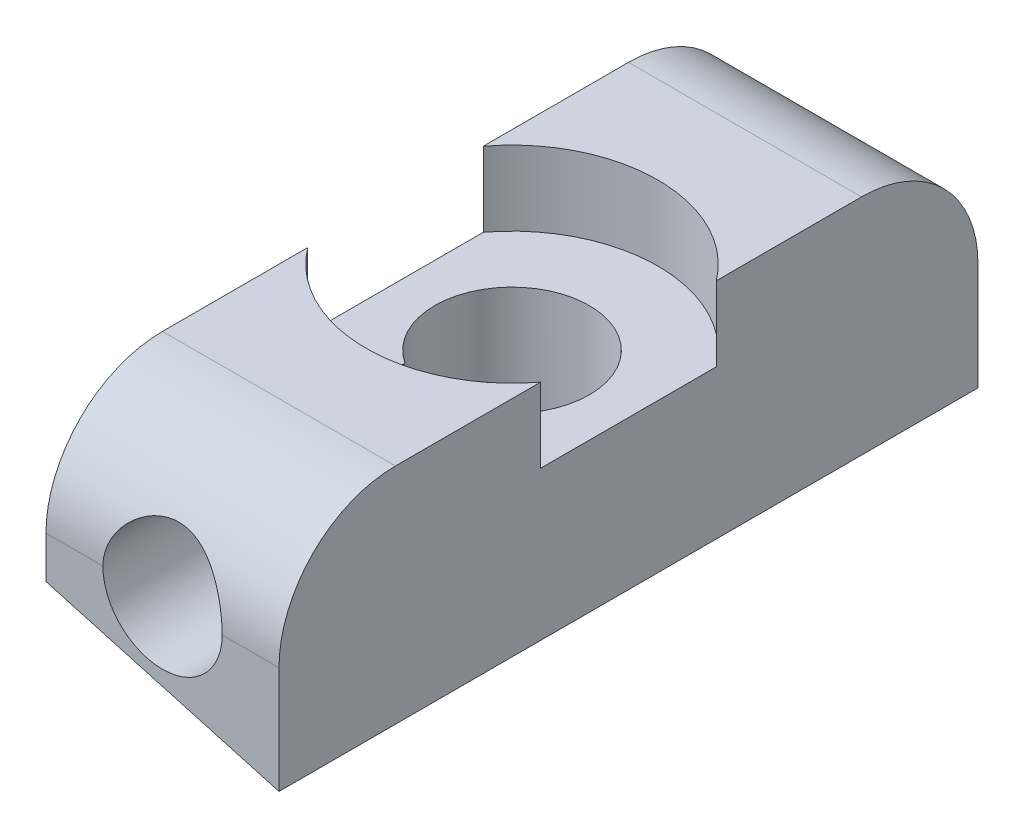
ISO-10303-21;
HEADER;
FILE_DESCRIPTION(('STEP AP214'),'2;1');
FILE_NAME('part.step','',(''),(''),'','','');
FILE_SCHEMA(('AUTOMOTIVE_DESIGN { 1 0 10303 214 1 1 1 1 }'));
ENDSEC;
DATA;
#1=APPLICATION_CONTEXT('core data for automotive mechanical design processes');
#2=APPLICATION_PROTOCOL_DEFINITION('international standard','automotive_design',2000,#1);
#3=PRODUCT_CONTEXT('',#1,'mechanical');
#4=PRODUCT('Part','Part','',(#3));
#5=PRODUCT_RELATED_PRODUCT_CATEGORY('part','',(#4));
#6=PRODUCT_DEFINITION_FORMATION('','',#4);
#7=PRODUCT_DEFINITION_CONTEXT('part definition',#1,'design');
#8=PRODUCT_DEFINITION('design','',#6,#7);
#9=PRODUCT_DEFINITION_SHAPE('','',#8);
#10=(LENGTH_UNIT() NAMED_UNIT(*) SI_UNIT(.MILLI.,.METRE.));
#11=(NAMED_UNIT(*) PLANE_ANGLE_UNIT() SI_UNIT($,.RADIAN.));
#12=(NAMED_UNIT(*) SI_UNIT($,.STERADIAN.) SOLID_ANGLE_UNIT());
#13=UNCERTAINTY_MEASURE_WITH_UNIT(LENGTH_MEASURE(1.E-05),#10,'distance_accuracy_value','');
#14=(GEOMETRIC_REPRESENTATION_CONTEXT(3) GLOBAL_UNCERTAINTY_ASSIGNED_CONTEXT((#13)) GLOBAL_UNIT_ASSIGNED_CONTEXT((#10,
#11,#12)) REPRESENTATION_CONTEXT('',''));
#15=CARTESIAN_POINT('',(0.,0.,0.));
#16=DIRECTION('',(0.,0.,1.));
#17=DIRECTION('',(1.,0.,0.));
#18=AXIS2_PLACEMENT_3D('',#15,#16,#17);
#19=CARTESIAN_POINT('',(-40.64,98.9032922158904,19.05));
#20=DIRECTION('',(0.,-1.,0.));
#21=DIRECTION('',(0.,0.,-1.));
#22=AXIS2_PLACEMENT_3D('',#19,#20,#21);
#23=PLANE('',#22);
#24=DIRECTION('',(0.,0.,-1.));
#25=VECTOR('',#24,1.);
#26=CARTESIAN_POINT('',(-34.29,98.9032922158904,19.05));
#27=LINE('',#26,#25);
#28=CARTESIAN_POINT('',(-34.29,98.9032922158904,15.875));
#29=VERTEX_POINT('',#28);
#30=CARTESIAN_POINT('',(-34.29,98.9032922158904,11.9168183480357));
#31=VERTEX_POINT('',#30);
#32=EDGE_CURVE('E190',#29,#31,#27,.T.);
#33=ORIENTED_EDGE('',*,*,#32,.T.);
#34=CARTESIAN_POINT('',(-37.465,98.9032922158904,9.525));
#35=DIRECTION('',(0.,1.,0.));
#36=DIRECTION('',(0.,0.,1.));
#37=AXIS2_PLACEMENT_3D('',#34,#35,#36);
#38=CIRCLE('',#37,3.97510000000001);
#39=CARTESIAN_POINT('',(-40.64,98.9032922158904,11.9168183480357));
#40=VERTEX_POINT('',#39);
#41=EDGE_CURVE('E144',#40,#31,#38,.T.);
#42=ORIENTED_EDGE('',*,*,#41,.F.);
#43=DIRECTION('',(0.,0.,-1.));
#44=VECTOR('',#43,1.);
#45=CARTESIAN_POINT('',(-40.64,98.9032922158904,19.05));
#46=LINE('',#45,#44);
#47=CARTESIAN_POINT('',(-40.64,98.9032922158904,15.875));
#48=VERTEX_POINT('',#47);
#49=EDGE_CURVE('E181',#48,#40,#46,.T.);
#50=ORIENTED_EDGE('',*,*,#49,.F.);
#51=DIRECTION('',(-1.,0.,0.));
#52=VECTOR('',#51,1.);
#53=CARTESIAN_POINT('',(-34.29,98.9032922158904,15.875));
#54=LINE('',#53,#52);
#55=EDGE_CURVE('E201',#48,#29,#54,.F.);
#56=ORIENTED_EDGE('',*,*,#55,.T.);
#57=EDGE_LOOP('',(#33,#42,#50,#56));
#58=FACE_BOUND('',#57,.T.);
#59=ADVANCED_FACE('F33',(#58),#23,.F.);
#60=CARTESIAN_POINT('',(-37.465,92.8072922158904,9.525));
#61=DIRECTION('',(0.,1.,0.));
#62=DIRECTION('',(0.,0.,1.));
#63=AXIS2_PLACEMENT_3D('',#60,#61,#62);
#64=CYLINDRICAL_SURFACE('',#63,2.1082);
#65=CARTESIAN_POINT('',(-37.465,93.6962922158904,9.525));
#66=DIRECTION('',(0.269629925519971,0.962964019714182,0.));
#67=DIRECTION('',(-0.962964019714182,0.269629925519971,0.));
#68=AXIS2_PLACEMENT_3D('',#65,#66,#67);
#69=ELLIPSE('',#68,2.18928221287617,2.1082);
#70=CARTESIAN_POINT('',(-39.5732,94.2865882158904,9.525));
#71=VERTEX_POINT('',#70);
#72=EDGE_CURVE('E260',#71,#71,#69,.T.);
#73=ORIENTED_EDGE('',*,*,#72,.F.);
#74=EDGE_LOOP('',(#73));
#75=FACE_BOUND('',#74,.T.);
#76=CARTESIAN_POINT('',(-37.465,96.8712922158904,9.525));
#77=DIRECTION('',(0.,1.,0.));
#78=DIRECTION('',(0.,0.,1.));
#79=AXIS2_PLACEMENT_3D('',#76,#77,#78);
#80=CIRCLE('',#79,2.1082);
#81=CARTESIAN_POINT('',(-38.620909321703,96.8712922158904,11.2880600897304));
#82=VERTEX_POINT('',#81);
#83=CARTESIAN_POINT('',(-36.309090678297,96.8712922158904,11.2880600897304));
#84=VERTEX_POINT('',#83);
#85=EDGE_CURVE('E141',#82,#84,#80,.F.);
#86=ORIENTED_EDGE('',*,*,#85,.F.);
#87=CARTESIAN_POINT('',(-36.309090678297,96.8712922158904,11.2880600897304));
#88=CARTESIAN_POINT('',(-36.2763970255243,96.8382149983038,11.2666321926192));
#89=CARTESIAN_POINT('',(-36.2452161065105,96.8038572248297,11.2448822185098));
#90=CARTESIAN_POINT('',(-36.1859072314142,96.7326110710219,11.2012397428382));
#91=CARTESIAN_POINT('',(-36.1577824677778,96.6957201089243,11.1793471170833));
#92=CARTESIAN_POINT('',(-36.1043284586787,96.6190003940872,11.1356792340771));
#93=CARTESIAN_POINT('',(-36.0790413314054,96.5791391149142,11.1139094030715));
#94=CARTESIAN_POINT('',(-36.0318304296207,96.496956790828,11.0714605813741));
#95=CARTESIAN_POINT('',(-36.0099049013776,96.454637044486,11.0507810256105));
#96=CARTESIAN_POINT('',(-35.9611052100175,96.3491995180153,11.0029739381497));
#97=CARTESIAN_POINT('',(-35.9360129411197,96.2848037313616,10.976780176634));
#98=CARTESIAN_POINT('',(-35.8938904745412,96.1514249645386,10.9310914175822));
#99=CARTESIAN_POINT('',(-35.8768210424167,96.0824662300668,10.9115639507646));
#100=CARTESIAN_POINT('',(-35.854020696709,95.9536514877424,10.8849657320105));
#101=CARTESIAN_POINT('',(-35.8467973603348,95.8944050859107,10.8762807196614));
#102=CARTESIAN_POINT('',(-35.8389657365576,95.7748489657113,10.866850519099));
#103=CARTESIAN_POINT('',(-35.8383530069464,95.7145399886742,10.8660999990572));
#104=CARTESIAN_POINT('',(-35.8437839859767,95.5947782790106,10.8726571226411));
#105=CARTESIAN_POINT('',(-35.8498181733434,95.5353244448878,10.8799532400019));
#106=CARTESIAN_POINT('',(-35.8680712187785,95.4186200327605,10.9014153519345));
#107=CARTESIAN_POINT('',(-35.8803008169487,95.3613734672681,10.9155932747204));
#108=CARTESIAN_POINT('',(-35.9173312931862,95.2238283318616,10.9568883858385));
#109=CARTESIAN_POINT('',(-35.945337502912,95.1452947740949,10.9869556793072));
#110=CARTESIAN_POINT('',(-36.0116734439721,94.9953726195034,11.0529214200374));
#111=CARTESIAN_POINT('',(-36.0500262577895,94.9240004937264,11.0888328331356));
#112=CARTESIAN_POINT('',(-36.1380397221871,94.7855549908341,11.1642645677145));
#113=CARTESIAN_POINT('',(-36.1881101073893,94.7187912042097,11.2038732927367));
#114=CARTESIAN_POINT('',(-36.2981370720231,94.5934113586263,11.2821274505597));
#115=CARTESIAN_POINT('',(-36.3580868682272,94.5347897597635,11.3207735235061));
#116=CARTESIAN_POINT('',(-36.4870209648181,94.4270949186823,11.3940940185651));
#117=CARTESIAN_POINT('',(-36.5559111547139,94.3779338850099,11.4288035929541));
#118=CARTESIAN_POINT('',(-36.7026025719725,94.2900245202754,11.4921346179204));
#119=CARTESIAN_POINT('',(-36.780395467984,94.2512665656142,11.5207616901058));
#120=CARTESIAN_POINT('',(-36.9305172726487,94.1912967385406,11.5655779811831));
#121=CARTESIAN_POINT('',(-37.0017433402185,94.1682735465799,11.5830219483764));
#122=CARTESIAN_POINT('',(-37.1480320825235,94.1321183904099,11.6105608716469));
#123=CARTESIAN_POINT('',(-37.2230921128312,94.1189797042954,11.6206608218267));
#124=CARTESIAN_POINT('',(-37.3752364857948,94.1033667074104,11.6326739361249));
#125=CARTESIAN_POINT('',(-37.4523267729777,94.100928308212,11.6345595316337));
#126=CARTESIAN_POINT('',(-37.6058193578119,94.1069825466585,11.6298926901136));
#127=CARTESIAN_POINT('',(-37.6822215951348,94.1154761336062,11.6233395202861));
#128=CARTESIAN_POINT('',(-37.8280800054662,94.142113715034,11.6029379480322));
#129=CARTESIAN_POINT('',(-37.8976907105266,94.1597321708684,11.5894871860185));
#130=CARTESIAN_POINT('',(-38.0326794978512,94.2033815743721,11.5565216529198));
#131=CARTESIAN_POINT('',(-38.0980566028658,94.2294144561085,11.5370054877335));
#132=CARTESIAN_POINT('',(-38.2295871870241,94.2917078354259,11.4910168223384));
#133=CARTESIAN_POINT('',(-38.295216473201,94.328708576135,11.4640574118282));
#134=CARTESIAN_POINT('',(-38.4195134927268,94.410332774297,11.4059907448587));
#135=CARTESIAN_POINT('',(-38.4781766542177,94.4549611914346,11.3748807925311));
#136=CARTESIAN_POINT('',(-38.5991749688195,94.560435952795,11.3037648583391));
#137=CARTESIAN_POINT('',(-38.659919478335,94.6227424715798,11.2632202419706));
#138=CARTESIAN_POINT('',(-38.7707014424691,94.7560555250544,11.1816175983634));
#139=CARTESIAN_POINT('',(-38.8207285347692,94.8270703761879,11.1405591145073));
#140=CARTESIAN_POINT('',(-38.9037579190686,94.967806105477,11.0668026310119));
#141=CARTESIAN_POINT('',(-38.9381237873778,95.0365126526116,11.0337093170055));
#142=CARTESIAN_POINT('',(-38.9974166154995,95.1803022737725,10.9734440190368));
#143=CARTESIAN_POINT('',(-39.0223639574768,95.2553711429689,10.9462593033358));
#144=CARTESIAN_POINT('',(-39.0564250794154,95.391366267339,10.9078817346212));
#145=CARTESIAN_POINT('',(-39.0679542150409,95.4510175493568,10.8943786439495));
#146=CARTESIAN_POINT('',(-39.0842624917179,95.5724144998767,10.8750603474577));
#147=CARTESIAN_POINT('',(-39.0890542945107,95.6341560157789,10.8692307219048));
#148=CARTESIAN_POINT('',(-39.0915115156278,95.7582148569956,10.8662582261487));
#149=CARTESIAN_POINT('',(-39.0891525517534,95.8205334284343,10.8691450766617));
#150=CARTESIAN_POINT('',(-39.0774688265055,95.9435953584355,10.8831337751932));
#151=CARTESIAN_POINT('',(-39.0681341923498,96.0043363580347,10.8942472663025));
#152=CARTESIAN_POINT('',(-39.039435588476,96.1404912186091,10.9272336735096));
#153=CARTESIAN_POINT('',(-39.017914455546,96.2148961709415,10.9513235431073));
#154=CARTESIAN_POINT('',(-38.9656564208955,96.3579349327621,11.0062069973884));
#155=CARTESIAN_POINT('',(-38.9348806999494,96.4265428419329,11.0370286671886));
#156=CARTESIAN_POINT('',(-38.8623906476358,96.5627148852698,11.1043782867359));
#157=CARTESIAN_POINT('',(-38.8200226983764,96.6298033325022,11.1411618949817));
#158=CARTESIAN_POINT('',(-38.7499751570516,96.7247551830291,11.1965940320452));
#159=CARTESIAN_POINT('',(-38.7256842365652,96.7553165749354,11.2150190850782));
#160=CARTESIAN_POINT('',(-38.6749260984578,96.8146504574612,11.2517211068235));
#161=CARTESIAN_POINT('',(-38.6484595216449,96.8434234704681,11.2699981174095));
#162=CARTESIAN_POINT('',(-38.620909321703,96.8712922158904,11.2880600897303));
#163=B_SPLINE_CURVE_WITH_KNOTS('',3,(#87,#88,#89,#90,#91,#92,#93,#94,#95,#96,#97,#98,#99,#100,
#101,#102,#103,#104,#105,#106,#107,#108,#109,#110,#111,#112,#113,#114,#115,#116,#117,#118,#119,
#120,#121,#122,#123,#124,#125,#126,#127,#128,#129,#130,#131,#132,#133,#134,#135,#136,#137,#138,
#139,#140,#141,#142,#143,#144,#145,#146,#147,#148,#149,#150,#151,#152,#153,#154,#155,#156,#157,
#158,#159,#160,#161,#162),.UNSPECIFIED.,.F.,.F.,(4,2,2,2,2,2,2,2,2,2,2,2,2,2,2,2,2,2,2,2,2,2,2,
2,2,2,2,2,2,2,2,2,2,2,2,2,2,4),(0.,0.153575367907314,0.307309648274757,0.46308698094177,
0.61878276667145,0.839785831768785,1.05969657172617,1.23983062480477,1.41984362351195,
1.59959910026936,1.77966726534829,2.04409559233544,2.30911878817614,2.5853536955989,
2.8613997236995,3.13474550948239,3.40783755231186,3.63743813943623,3.86688244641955,
4.09709621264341,4.32732997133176,4.54557516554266,4.76387055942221,5.00305191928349,
5.24238939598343,5.52933373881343,5.8165542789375,6.06673188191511,6.31636494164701,
6.50234171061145,6.68796849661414,6.87422893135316,7.06075348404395,7.30275281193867,
7.54578173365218,7.80728256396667,7.9367123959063,8.06610424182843),.UNSPECIFIED.);
#164=EDGE_CURVE('E125',#84,#82,#163,.T.);
#165=ORIENTED_EDGE('',*,*,#164,.F.);
#166=EDGE_LOOP('',(#86,#165));
#167=FACE_BOUND('',#166,.T.);
#168=ADVANCED_FACE('F146',(#75,#167),#64,.F.);
#169=CARTESIAN_POINT('',(-40.64,94.5852922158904,19.05));
#170=DIRECTION('',(0.269629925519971,0.962964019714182,0.));
#171=DIRECTION('',(-0.962964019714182,0.269629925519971,0.));
#172=AXIS2_PLACEMENT_3D('',#169,#170,#171);
#173=PLANE('',#172);
#174=ORIENTED_EDGE('',*,*,#72,.T.);
#175=EDGE_LOOP('',(#174));
#176=FACE_BOUND('',#175,.T.);
#177=DIRECTION('',(0.962964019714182,-0.269629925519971,0.));
#178=VECTOR('',#177,1.);
#179=CARTESIAN_POINT('',(-40.64,94.5852922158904,0.));
#180=LINE('',#179,#178);
#181=CARTESIAN_POINT('',(-40.64,94.5852922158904,0.));
#182=VERTEX_POINT('',#181);
#183=CARTESIAN_POINT('',(-34.29,92.8072922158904,0.));
#184=VERTEX_POINT('',#183);
#185=EDGE_CURVE('E263',#182,#184,#180,.T.);
#186=ORIENTED_EDGE('',*,*,#185,.T.);
#187=DIRECTION('',(0.,0.,-1.));
#188=VECTOR('',#187,1.);
#189=CARTESIAN_POINT('',(-34.29,92.8072922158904,19.05));
#190=LINE('',#189,#188);
#191=CARTESIAN_POINT('',(-34.29,92.8072922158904,19.05));
#192=VERTEX_POINT('',#191);
#193=EDGE_CURVE('E193',#192,#184,#190,.T.);
#194=ORIENTED_EDGE('',*,*,#193,.F.);
#195=DIRECTION('',(0.962964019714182,-0.269629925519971,0.));
#196=VECTOR('',#195,1.);
#197=CARTESIAN_POINT('',(-40.64,94.5852922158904,19.05));
#198=LINE('',#197,#196);
#199=CARTESIAN_POINT('',(-40.64,94.5852922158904,19.05));
#200=VERTEX_POINT('',#199);
#201=EDGE_CURVE('E219',#200,#192,#198,.T.);
#202=ORIENTED_EDGE('',*,*,#201,.F.);
#203=DIRECTION('',(0.,0.,-1.));
#204=VECTOR('',#203,1.);
#205=CARTESIAN_POINT('',(-40.64,94.5852922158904,19.05));
#206=LINE('',#205,#204);
#207=EDGE_CURVE('E182',#200,#182,#206,.T.);
#208=ORIENTED_EDGE('',*,*,#207,.T.);
#209=EDGE_LOOP('',(#186,#194,#202,#208));
#210=FACE_BOUND('',#209,.T.);
#211=ADVANCED_FACE('F35',(#176,#210),#173,.F.);
#212=CARTESIAN_POINT('',(-34.29,92.8072922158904,19.05));
#213=DIRECTION('',(-1.,0.,0.));
#214=DIRECTION('',(0.,0.,1.));
#215=AXIS2_PLACEMENT_3D('',#212,#213,#214);
#216=PLANE('',#215);
#217=DIRECTION('',(0.,1.,0.));
#218=VECTOR('',#217,1.);
#219=CARTESIAN_POINT('',(-34.29,92.8072922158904,0.));
#220=LINE('',#219,#218);
#221=CARTESIAN_POINT('',(-34.29,95.7282922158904,0.));
#222=VERTEX_POINT('',#221);
#223=EDGE_CURVE('E266',#184,#222,#220,.T.);
#224=ORIENTED_EDGE('',*,*,#223,.T.);
#225=CARTESIAN_POINT('',(-34.29,95.7282922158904,3.175));
#226=DIRECTION('',(-1.,0.,0.));
#227=DIRECTION('',(0.,0.,1.));
#228=AXIS2_PLACEMENT_3D('',#225,#226,#227);
#229=CIRCLE('',#228,3.175);
#230=CARTESIAN_POINT('',(-34.29,98.9032922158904,3.17500000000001));
#231=VERTEX_POINT('',#230);
#232=EDGE_CURVE('E11',#222,#231,#229,.F.);
#233=ORIENTED_EDGE('',*,*,#232,.T.);
#234=CARTESIAN_POINT('',(-34.29,98.9032922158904,7.13318165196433));
#235=VERTEX_POINT('',#234);
#236=EDGE_CURVE('E175',#235,#231,#27,.T.);
#237=ORIENTED_EDGE('',*,*,#236,.F.);
#238=DIRECTION('',(0.,1.,0.));
#239=VECTOR('',#238,1.);
#240=CARTESIAN_POINT('',(-34.29,96.8712922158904,7.13318165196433));
#241=LINE('',#240,#239);
#242=CARTESIAN_POINT('',(-34.29,96.8712922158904,7.13318165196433));
#243=VERTEX_POINT('',#242);
#244=EDGE_CURVE('E255',#235,#243,#241,.F.);
#245=ORIENTED_EDGE('',*,*,#244,.T.);
#246=DIRECTION('',(0.,0.,-1.));
#247=VECTOR('',#246,1.);
#248=CARTESIAN_POINT('',(-34.29,96.8712922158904,19.05));
#249=LINE('',#248,#247);
#250=CARTESIAN_POINT('',(-34.29,96.8712922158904,11.9168183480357));
#251=VERTEX_POINT('',#250);
#252=EDGE_CURVE('E150',#251,#243,#249,.T.);
#253=ORIENTED_EDGE('',*,*,#252,.F.);
#254=DIRECTION('',(0.,1.,0.));
#255=VECTOR('',#254,1.);
#256=CARTESIAN_POINT('',(-34.29,96.8712922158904,11.9168183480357));
#257=LINE('',#256,#255);
#258=EDGE_CURVE('E258',#251,#31,#257,.T.);
#259=ORIENTED_EDGE('',*,*,#258,.T.);
#260=ORIENTED_EDGE('',*,*,#32,.F.);
#261=CARTESIAN_POINT('',(-34.29,95.7282922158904,15.875));
#262=DIRECTION('',(-1.,0.,0.));
#263=DIRECTION('',(0.,0.,1.));
#264=AXIS2_PLACEMENT_3D('',#261,#262,#263);
#265=CIRCLE('',#264,3.175);
#266=CARTESIAN_POINT('',(-34.29,95.7282922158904,19.05));
#267=VERTEX_POINT('',#266);
#268=EDGE_CURVE('E156',#29,#267,#265,.F.);
#269=ORIENTED_EDGE('',*,*,#268,.T.);
#270=DIRECTION('',(0.,1.,0.));
#271=VECTOR('',#270,1.);
#272=CARTESIAN_POINT('',(-34.29,92.8072922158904,19.05));
#273=LINE('',#272,#271);
#274=EDGE_CURVE('E210',#192,#267,#273,.T.);
#275=ORIENTED_EDGE('',*,*,#274,.F.);
#276=ORIENTED_EDGE('',*,*,#193,.T.);
#277=EDGE_LOOP('',(#224,#233,#237,#245,#253,#259,#260,#269,#275,#276));
#278=FACE_BOUND('',#277,.T.);
#279=ADVANCED_FACE('F209',(#278),#216,.F.);
#280=ORIENTED_EDGE('',*,*,#236,.T.);
#281=DIRECTION('',(-1.,0.,0.));
#282=VECTOR('',#281,1.);
#283=CARTESIAN_POINT('',(-40.64,98.9032922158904,3.175));
#284=LINE('',#283,#282);
#285=CARTESIAN_POINT('',(-40.64,98.9032922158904,3.17500000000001));
#286=VERTEX_POINT('',#285);
#287=EDGE_CURVE('E164',#231,#286,#284,.T.);
#288=ORIENTED_EDGE('',*,*,#287,.T.);
#289=CARTESIAN_POINT('',(-40.64,98.9032922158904,7.13318165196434));
#290=VERTEX_POINT('',#289);
#291=EDGE_CURVE('E173',#290,#286,#46,.T.);
#292=ORIENTED_EDGE('',*,*,#291,.F.);
#293=EDGE_CURVE('E252',#235,#290,#38,.T.);
#294=ORIENTED_EDGE('',*,*,#293,.F.);
#295=EDGE_LOOP('',(#280,#288,#292,#294));
#296=FACE_BOUND('',#295,.T.);
#297=ADVANCED_FACE('F171',(#296),#23,.F.);
#298=CARTESIAN_POINT('',(-40.64,94.5852922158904,19.05));
#299=DIRECTION('',(1.,0.,0.));
#300=DIRECTION('',(0.,0.,-1.));
#301=AXIS2_PLACEMENT_3D('',#298,#299,#300);
#302=PLANE('',#301);
#303=ORIENTED_EDGE('',*,*,#291,.T.);
#304=CARTESIAN_POINT('',(-40.64,95.7282922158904,3.175));
#305=DIRECTION('',(1.,0.,0.));
#306=DIRECTION('',(0.,0.,-1.));
#307=AXIS2_PLACEMENT_3D('',#304,#305,#306);
#308=CIRCLE('',#307,3.175);
#309=CARTESIAN_POINT('',(-40.64,95.7282922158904,0.));
#310=VERTEX_POINT('',#309);
#311=EDGE_CURVE('E55',#286,#310,#308,.F.);
#312=ORIENTED_EDGE('',*,*,#311,.T.);
#313=DIRECTION('',(0.,-1.,0.));
#314=VECTOR('',#313,1.);
#315=CARTESIAN_POINT('',(-40.64,94.5852922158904,0.));
#316=LINE('',#315,#314);
#317=EDGE_CURVE('E268',#310,#182,#316,.T.);
#318=ORIENTED_EDGE('',*,*,#317,.T.);
#319=ORIENTED_EDGE('',*,*,#207,.F.);
#320=DIRECTION('',(0.,-1.,0.));
#321=VECTOR('',#320,1.);
#322=CARTESIAN_POINT('',(-40.64,94.5852922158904,19.05));
#323=LINE('',#322,#321);
#324=CARTESIAN_POINT('',(-40.64,95.7282922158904,19.05));
#325=VERTEX_POINT('',#324);
#326=EDGE_CURVE('E186',#325,#200,#323,.T.);
#327=ORIENTED_EDGE('',*,*,#326,.F.);
#328=CARTESIAN_POINT('',(-40.64,95.7282922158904,15.875));
#329=DIRECTION('',(1.,0.,0.));
#330=DIRECTION('',(0.,0.,-1.));
#331=AXIS2_PLACEMENT_3D('',#328,#329,#330);
#332=CIRCLE('',#331,3.175);
#333=EDGE_CURVE('E200',#325,#48,#332,.F.);
#334=ORIENTED_EDGE('',*,*,#333,.T.);
#335=ORIENTED_EDGE('',*,*,#49,.T.);
#336=DIRECTION('',(0.,1.,0.));
#337=VECTOR('',#336,1.);
#338=CARTESIAN_POINT('',(-40.64,96.8712922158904,11.9168183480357));
#339=LINE('',#338,#337);
#340=CARTESIAN_POINT('',(-40.64,96.8712922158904,11.9168183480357));
#341=VERTEX_POINT('',#340);
#342=EDGE_CURVE('E158',#40,#341,#339,.F.);
#343=ORIENTED_EDGE('',*,*,#342,.T.);
#344=DIRECTION('',(0.,0.,1.));
#345=VECTOR('',#344,1.);
#346=CARTESIAN_POINT('',(-40.64,96.8712922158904,19.05));
#347=LINE('',#346,#345);
#348=CARTESIAN_POINT('',(-40.64,96.8712922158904,7.13318165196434));
#349=VERTEX_POINT('',#348);
#350=EDGE_CURVE('E147',#349,#341,#347,.T.);
#351=ORIENTED_EDGE('',*,*,#350,.F.);
#352=DIRECTION('',(0.,1.,0.));
#353=VECTOR('',#352,1.);
#354=CARTESIAN_POINT('',(-40.64,96.8712922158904,7.13318165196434));
#355=LINE('',#354,#353);
#356=EDGE_CURVE('E161',#349,#290,#355,.T.);
#357=ORIENTED_EDGE('',*,*,#356,.T.);
#358=EDGE_LOOP('',(#303,#312,#318,#319,#327,#334,#335,#343,#351,#357));
#359=FACE_BOUND('',#358,.T.);
#360=ADVANCED_FACE('F178',(#359),#302,.F.);
#361=CARTESIAN_POINT('',(-34.29,92.8072922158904,19.05));
#362=DIRECTION('',(0.,0.,1.));
#363=DIRECTION('',(1.,0.,0.));
#364=AXIS2_PLACEMENT_3D('',#361,#362,#363);
#365=PLANE('',#364);
#366=CARTESIAN_POINT('',(-37.465,95.7282922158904,19.05));
#367=DIRECTION('',(0.,0.,1.));
#368=DIRECTION('',(1.,0.,0.));
#369=AXIS2_PLACEMENT_3D('',#366,#367,#368);
#370=CIRCLE('',#369,1.6256);
#371=CARTESIAN_POINT('',(-39.0906,95.7282922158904,19.05));
#372=VERTEX_POINT('',#371);
#373=CARTESIAN_POINT('',(-35.8394,95.7282922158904,19.05));
#374=VERTEX_POINT('',#373);
#375=EDGE_CURVE('E227',#372,#374,#370,.T.);
#376=ORIENTED_EDGE('',*,*,#375,.F.);
#377=DIRECTION('',(-1.,0.,0.));
#378=VECTOR('',#377,1.);
#379=CARTESIAN_POINT('',(-34.29,95.7282922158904,19.05));
#380=LINE('',#379,#378);
#381=EDGE_CURVE('E196',#372,#325,#380,.T.);
#382=ORIENTED_EDGE('',*,*,#381,.T.);
#383=ORIENTED_EDGE('',*,*,#326,.T.);
#384=ORIENTED_EDGE('',*,*,#201,.T.);
#385=ORIENTED_EDGE('',*,*,#274,.T.);
#386=EDGE_CURVE('E197',#267,#374,#380,.T.);
#387=ORIENTED_EDGE('',*,*,#386,.T.);
#388=EDGE_LOOP('',(#376,#382,#383,#384,#385,#387));
#389=FACE_BOUND('',#388,.T.);
#390=ADVANCED_FACE('F217',(#389),#365,.T.);
#391=CARTESIAN_POINT('',(-34.29,92.8072922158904,0.));
#392=DIRECTION('',(0.,0.,1.));
#393=DIRECTION('',(1.,0.,0.));
#394=AXIS2_PLACEMENT_3D('',#391,#392,#393);
#395=PLANE('',#394);
#396=ORIENTED_EDGE('',*,*,#317,.F.);
#397=DIRECTION('',(-1.,0.,0.));
#398=VECTOR('',#397,1.);
#399=CARTESIAN_POINT('',(-34.29,95.7282922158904,0.));
#400=LINE('',#399,#398);
#401=EDGE_CURVE('E41',#310,#222,#400,.F.);
#402=ORIENTED_EDGE('',*,*,#401,.T.);
#403=ORIENTED_EDGE('',*,*,#223,.F.);
#404=ORIENTED_EDGE('',*,*,#185,.F.);
#405=EDGE_LOOP('',(#396,#402,#403,#404));
#406=FACE_BOUND('',#405,.T.);
#407=ADVANCED_FACE('F352',(#406),#395,.F.);
#408=CARTESIAN_POINT('',(-34.29,95.7282922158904,15.875));
#409=DIRECTION('',(1.,0.,0.));
#410=DIRECTION('',(0.,0.,-1.));
#411=AXIS2_PLACEMENT_3D('',#408,#409,#410);
#412=CYLINDRICAL_SURFACE('',#411,3.175);
#413=CARTESIAN_POINT('',(-39.0906,95.7282922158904,19.05));
#414=CARTESIAN_POINT('',(-39.090606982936,95.7710783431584,19.0500077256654));
#415=CARTESIAN_POINT('',(-39.0889109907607,95.8138594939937,19.0491353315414));
#416=CARTESIAN_POINT('',(-39.0821672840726,95.8990705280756,19.0456883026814));
#417=CARTESIAN_POINT('',(-39.0771209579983,95.941500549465,19.0431143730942));
#418=CARTESIAN_POINT('',(-39.0637617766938,96.0255087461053,19.0363379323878));
#419=CARTESIAN_POINT('',(-39.0554641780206,96.0670899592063,19.0321430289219));
#420=CARTESIAN_POINT('',(-39.0357060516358,96.1492998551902,19.0222360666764));
#421=CARTESIAN_POINT('',(-39.0242453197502,96.1899284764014,19.0165239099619));
#422=CARTESIAN_POINT('',(-38.9853231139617,96.309873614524,18.9973251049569));
#423=CARTESIAN_POINT('',(-38.9532922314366,96.3874307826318,18.9817606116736));
#424=CARTESIAN_POINT('',(-38.8782067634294,96.5359887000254,18.9464992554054));
#425=CARTESIAN_POINT('',(-38.8351408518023,96.6069826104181,18.9267981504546));
#426=CARTESIAN_POINT('',(-38.7361830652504,96.7453167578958,18.8836294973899));
#427=CARTESIAN_POINT('',(-38.6796613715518,96.8121573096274,18.8600041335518));
#428=CARTESIAN_POINT('',(-38.5567642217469,96.9358682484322,18.8121405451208));
#429=CARTESIAN_POINT('',(-38.4903819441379,96.9927316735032,18.7879019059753));
#430=CARTESIAN_POINT('',(-38.3430955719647,97.0995928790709,18.7392423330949));
#431=CARTESIAN_POINT('',(-38.2614456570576,97.1486391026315,18.7149708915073));
#432=CARTESIAN_POINT('',(-38.0896957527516,97.2320962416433,18.6716807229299));
#433=CARTESIAN_POINT('',(-37.9996022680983,97.2665183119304,18.6526579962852));
#434=CARTESIAN_POINT('',(-37.8190972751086,97.3174532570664,18.6238193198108));
#435=CARTESIAN_POINT('',(-37.7290404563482,97.3349305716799,18.6135125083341));
#436=CARTESIAN_POINT('',(-37.5467309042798,97.3544148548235,18.6019935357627));
#437=CARTESIAN_POINT('',(-37.4544805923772,97.3564381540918,18.6007717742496));
#438=CARTESIAN_POINT('',(-37.2830090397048,97.3456619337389,18.6071705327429));
#439=CARTESIAN_POINT('',(-37.2036200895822,97.334711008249,18.6136885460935));
#440=CARTESIAN_POINT('',(-37.0480188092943,97.3015161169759,18.6328896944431));
#441=CARTESIAN_POINT('',(-36.9718075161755,97.2792684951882,18.6455748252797));
#442=CARTESIAN_POINT('',(-36.8225461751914,97.2237257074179,18.675949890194));
#443=CARTESIAN_POINT('',(-36.749610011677,97.1901869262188,18.6937487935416));
#444=CARTESIAN_POINT('',(-36.6100408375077,97.1132036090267,18.7323585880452));
#445=CARTESIAN_POINT('',(-36.5434108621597,97.0697543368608,18.7531709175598));
#446=CARTESIAN_POINT('',(-36.4089645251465,96.967414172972,18.7988230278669));
#447=CARTESIAN_POINT('',(-36.3421817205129,96.9072351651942,18.8238291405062));
#448=CARTESIAN_POINT('',(-36.2192088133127,96.7764529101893,18.8728093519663));
#449=CARTESIAN_POINT('',(-36.1630248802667,96.7058436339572,18.89678284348));
#450=CARTESIAN_POINT('',(-36.0601224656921,96.551649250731,18.9424900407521));
#451=CARTESIAN_POINT('',(-36.0140387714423,96.4675837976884,18.9640453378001));
#452=CARTESIAN_POINT('',(-35.9370973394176,96.291564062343,19.000922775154));
#453=CARTESIAN_POINT('',(-35.9062114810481,96.1996247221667,19.0162564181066));
#454=CARTESIAN_POINT('',(-35.869076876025,96.0438766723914,19.0348829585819));
#455=CARTESIAN_POINT('',(-35.8579904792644,95.9814631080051,19.0405109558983));
#456=CARTESIAN_POINT('',(-35.8431357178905,95.8554835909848,19.0480870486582));
#457=CARTESIAN_POINT('',(-35.8393756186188,95.7919164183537,19.0500309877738));
#458=CARTESIAN_POINT('',(-35.8394,95.7282922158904,19.05));
#459=B_SPLINE_CURVE_WITH_KNOTS('',3,(#413,#414,#415,#416,#417,#418,#419,#420,#421,#422,#423,
#424,#425,#426,#427,#428,#429,#430,#431,#432,#433,#434,#435,#436,#437,#438,#439,#440,#441,#442,
#443,#444,#445,#446,#447,#448,#449,#450,#451,#452,#453,#454,#455,#456,#457,#458),.UNSPECIFIED.,
.F.,.F.,(4,2,2,2,2,2,2,2,2,2,2,2,2,2,2,2,2,2,2,2,2,2,4),(0.,0.128307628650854,0.256562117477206,
0.384221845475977,0.511889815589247,0.766679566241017,1.02173188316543,1.29260270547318,
1.56366179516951,1.85705179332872,2.15021759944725,2.42549893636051,2.70048933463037,
2.9405803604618,3.18074913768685,3.42647272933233,3.67231399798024,3.95104079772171,
4.22992934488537,4.52314960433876,4.81582525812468,5.00624004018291,5.19686951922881),.UNSPECIFIED.);
#460=EDGE_CURVE('E225',#372,#374,#459,.T.);
#461=ORIENTED_EDGE('',*,*,#460,.T.);
#462=ORIENTED_EDGE('',*,*,#386,.F.);
#463=ORIENTED_EDGE('',*,*,#268,.F.);
#464=ORIENTED_EDGE('',*,*,#55,.F.);
#465=ORIENTED_EDGE('',*,*,#333,.F.);
#466=ORIENTED_EDGE('',*,*,#381,.F.);
#467=EDGE_LOOP('',(#461,#462,#463,#464,#465,#466));
#468=FACE_BOUND('',#467,.T.);
#469=ADVANCED_FACE('F223',(#468),#412,.T.);
#470=CARTESIAN_POINT('',(-37.465,96.8712922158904,9.525));
#471=DIRECTION('',(0.,1.,0.));
#472=DIRECTION('',(0.,0.,1.));
#473=AXIS2_PLACEMENT_3D('',#470,#471,#472);
#474=CYLINDRICAL_SURFACE('',#473,3.97510000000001);
#475=CARTESIAN_POINT('',(-37.465,96.8712922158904,9.525));
#476=DIRECTION('',(0.,1.,0.));
#477=DIRECTION('',(0.,0.,1.));
#478=AXIS2_PLACEMENT_3D('',#475,#476,#477);
#479=CIRCLE('',#478,3.97510000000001);
#480=CARTESIAN_POINT('',(-36.309090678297,96.8712922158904,13.3283266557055));
#481=VERTEX_POINT('',#480);
#482=EDGE_CURVE('E153',#481,#251,#479,.T.);
#483=ORIENTED_EDGE('',*,*,#482,.F.);
#484=CARTESIAN_POINT('',(-38.620909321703,96.8712922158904,13.3283266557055));
#485=CARTESIAN_POINT('',(-38.5892494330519,96.9033056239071,13.3379488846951));
#486=CARTESIAN_POINT('',(-38.5562723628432,96.9339972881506,13.3475387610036));
#487=CARTESIAN_POINT('',(-38.487827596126,96.9925836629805,13.3664198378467));
#488=CARTESIAN_POINT('',(-38.4523593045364,97.0204777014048,13.3757109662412));
#489=CARTESIAN_POINT('',(-38.3423495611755,97.0997884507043,13.402804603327));
#490=CARTESIAN_POINT('',(-38.2642970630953,97.1467388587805,13.4197977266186));
#491=CARTESIAN_POINT('',(-38.100664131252,97.2272395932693,13.4498292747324));
#492=CARTESIAN_POINT('',(-38.0150682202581,97.2607615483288,13.4628593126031));
#493=CARTESIAN_POINT('',(-37.8389273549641,97.3129583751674,13.4834633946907));
#494=CARTESIAN_POINT('',(-37.7483899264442,97.3316551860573,13.4910454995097));
#495=CARTESIAN_POINT('',(-37.5697567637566,97.3528797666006,13.499675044));
#496=CARTESIAN_POINT('',(-37.4817662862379,97.356171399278,13.5010311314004));
#497=CARTESIAN_POINT('',(-37.3065019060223,97.3485222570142,13.4979054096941));
#498=CARTESIAN_POINT('',(-37.2192280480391,97.33758060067,13.4934232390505));
#499=CARTESIAN_POINT('',(-37.0508446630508,97.3025247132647,13.4793403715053));
#500=CARTESIAN_POINT('',(-36.9696268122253,97.2788551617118,13.4699127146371));
#501=CARTESIAN_POINT('',(-36.8123020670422,97.2194778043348,13.4469553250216));
#502=CARTESIAN_POINT('',(-36.7361978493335,97.1837637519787,13.4334234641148));
#503=CARTESIAN_POINT('',(-36.5982520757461,97.1055919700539,13.4050267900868));
#504=CARTESIAN_POINT('',(-36.5357474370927,97.0641927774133,13.3904384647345));
#505=CARTESIAN_POINT('',(-36.4173103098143,96.973476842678,13.3600406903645));
#506=CARTESIAN_POINT('',(-36.3613647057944,96.9241763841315,13.3442337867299));
#507=CARTESIAN_POINT('',(-36.309090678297,96.8712922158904,13.3283266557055));
#508=B_SPLINE_CURVE_WITH_KNOTS('',3,(#484,#485,#486,#487,#488,#489,#490,#491,#492,#493,#494,
#495,#496,#497,#498,#499,#500,#501,#502,#503,#504,#505,#506,#507),.UNSPECIFIED.,.F.,.F.,(4,2,2,
2,2,2,2,2,2,2,2,4),(0.,0.138044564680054,0.27612221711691,0.552682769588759,0.829824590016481,
1.10655551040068,1.36940821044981,1.63227718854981,1.88650802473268,2.14087091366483,
2.3693048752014,2.59727397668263),.UNSPECIFIED.);
#509=CARTESIAN_POINT('',(-38.620909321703,96.8712922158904,13.3283266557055));
#510=VERTEX_POINT('',#509);
#511=EDGE_CURVE('E136',#510,#481,#508,.T.);
#512=ORIENTED_EDGE('',*,*,#511,.F.);
#513=EDGE_CURVE('E143',#341,#510,#479,.T.);
#514=ORIENTED_EDGE('',*,*,#513,.F.);
#515=ORIENTED_EDGE('',*,*,#342,.F.);
#516=ORIENTED_EDGE('',*,*,#41,.T.);
#517=ORIENTED_EDGE('',*,*,#258,.F.);
#518=EDGE_LOOP('',(#483,#512,#514,#515,#516,#517));
#519=FACE_BOUND('',#518,.T.);
#520=ADVANCED_FACE('F313',(#519),#474,.F.);
#521=ORIENTED_EDGE('',*,*,#293,.T.);
#522=ORIENTED_EDGE('',*,*,#356,.F.);
#523=EDGE_CURVE('E148',#243,#349,#479,.T.);
#524=ORIENTED_EDGE('',*,*,#523,.F.);
#525=ORIENTED_EDGE('',*,*,#244,.F.);
#526=EDGE_LOOP('',(#521,#522,#524,#525));
#527=FACE_BOUND('',#526,.T.);
#528=ADVANCED_FACE('F319',(#527),#474,.F.);
#529=CARTESIAN_POINT('',(-37.465,96.8712922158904,9.525));
#530=DIRECTION('',(0.,1.,0.));
#531=DIRECTION('',(0.,0.,1.));
#532=AXIS2_PLACEMENT_3D('',#529,#530,#531);
#533=PLANE('',#532);
#534=DIRECTION('',(0.,0.,1.));
#535=VECTOR('',#534,1.);
#536=CARTESIAN_POINT('',(-38.620909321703,96.8712922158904,-0.001000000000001));
#537=LINE('',#536,#535);
#538=EDGE_CURVE('E129',#510,#82,#537,.F.);
#539=ORIENTED_EDGE('',*,*,#538,.T.);
#540=ORIENTED_EDGE('',*,*,#85,.T.);
#541=DIRECTION('',(0.,0.,1.));
#542=VECTOR('',#541,1.);
#543=CARTESIAN_POINT('',(-36.309090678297,96.8712922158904,-0.001000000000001));
#544=LINE('',#543,#542);
#545=EDGE_CURVE('E132',#84,#481,#544,.T.);
#546=ORIENTED_EDGE('',*,*,#545,.T.);
#547=ORIENTED_EDGE('',*,*,#482,.T.);
#548=ORIENTED_EDGE('',*,*,#252,.T.);
#549=ORIENTED_EDGE('',*,*,#523,.T.);
#550=ORIENTED_EDGE('',*,*,#350,.T.);
#551=ORIENTED_EDGE('',*,*,#513,.T.);
#552=EDGE_LOOP('',(#539,#540,#546,#547,#548,#549,#550,#551));
#553=FACE_BOUND('',#552,.T.);
#554=ADVANCED_FACE('F140',(#553),#533,.T.);
#555=CARTESIAN_POINT('',(-37.465,95.7282922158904,-0.001000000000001));
#556=DIRECTION('',(0.,0.,1.));
#557=DIRECTION('',(1.,0.,0.));
#558=AXIS2_PLACEMENT_3D('',#555,#556,#557);
#559=CYLINDRICAL_SURFACE('',#558,1.6256);
#560=ORIENTED_EDGE('',*,*,#511,.T.);
#561=ORIENTED_EDGE('',*,*,#545,.F.);
#562=ORIENTED_EDGE('',*,*,#164,.T.);
#563=ORIENTED_EDGE('',*,*,#538,.F.);
#564=EDGE_LOOP('',(#560,#561,#562,#563));
#565=FACE_BOUND('',#564,.T.);
#566=ORIENTED_EDGE('',*,*,#375,.T.);
#567=ORIENTED_EDGE('',*,*,#460,.F.);
#568=EDGE_LOOP('',(#566,#567));
#569=FACE_BOUND('',#568,.T.);
#570=ADVANCED_FACE('F127',(#565,#569),#559,.F.);
#571=CARTESIAN_POINT('',(-40.64,95.7282922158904,3.175));
#572=DIRECTION('',(-1.,0.,0.));
#573=DIRECTION('',(0.,0.,1.));
#574=AXIS2_PLACEMENT_3D('',#571,#572,#573);
#575=CYLINDRICAL_SURFACE('',#574,3.175);
#576=ORIENTED_EDGE('',*,*,#232,.F.);
#577=ORIENTED_EDGE('',*,*,#401,.F.);
#578=ORIENTED_EDGE('',*,*,#311,.F.);
#579=ORIENTED_EDGE('',*,*,#287,.F.);
#580=EDGE_LOOP('',(#576,#577,#578,#579));
#581=FACE_BOUND('',#580,.T.);
#582=ADVANCED_FACE('F274',(#581),#575,.T.);
#583=CLOSED_SHELL('',(#59,#168,#211,#279,#297,#360,#390,#407,#469,#520,#528,#554,#570,#582));
#584=MANIFOLD_SOLID_BREP('B2',#583);
#585=ADVANCED_BREP_SHAPE_REPRESENTATION('',(#18,#584),#14);
#586=SHAPE_DEFINITION_REPRESENTATION(#9,#585);
ENDSEC;
END-ISO-10303-21;
